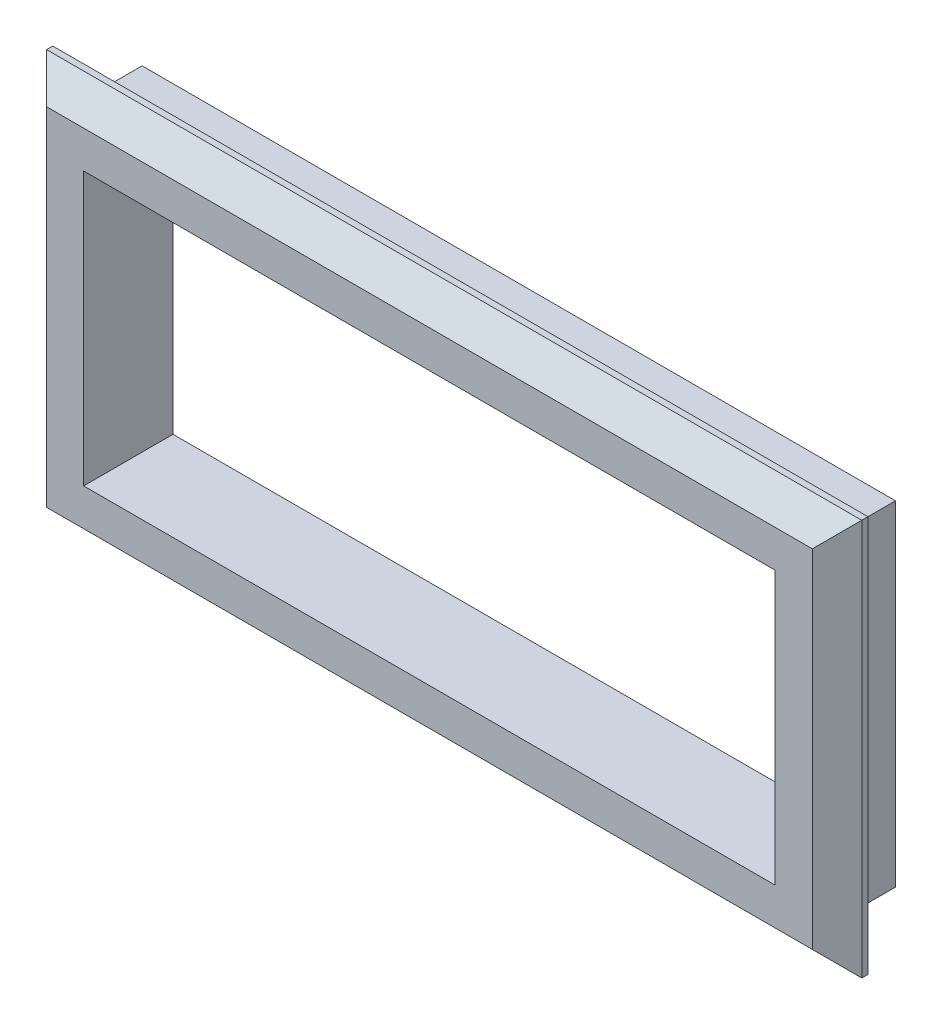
ISO-10303-21;
HEADER;
FILE_DESCRIPTION(('STEP AP214'),'2;1');
FILE_NAME('part.step','',(''),(''),'','','');
FILE_SCHEMA(('AUTOMOTIVE_DESIGN { 1 0 10303 214 1 1 1 1 }'));
ENDSEC;
DATA;
#1=APPLICATION_CONTEXT('core data for automotive mechanical design processes');
#2=APPLICATION_PROTOCOL_DEFINITION('international standard','automotive_design',2000,#1);
#3=PRODUCT_CONTEXT('',#1,'mechanical');
#4=PRODUCT('Part','Part','',(#3));
#5=PRODUCT_RELATED_PRODUCT_CATEGORY('part','',(#4));
#6=PRODUCT_DEFINITION_FORMATION('','',#4);
#7=PRODUCT_DEFINITION_CONTEXT('part definition',#1,'design');
#8=PRODUCT_DEFINITION('design','',#6,#7);
#9=PRODUCT_DEFINITION_SHAPE('','',#8);
#10=(LENGTH_UNIT() NAMED_UNIT(*) SI_UNIT(.MILLI.,.METRE.));
#11=(NAMED_UNIT(*) PLANE_ANGLE_UNIT() SI_UNIT($,.RADIAN.));
#12=(NAMED_UNIT(*) SI_UNIT($,.STERADIAN.) SOLID_ANGLE_UNIT());
#13=UNCERTAINTY_MEASURE_WITH_UNIT(LENGTH_MEASURE(1.E-05),#10,'distance_accuracy_value','');
#14=(GEOMETRIC_REPRESENTATION_CONTEXT(3) GLOBAL_UNCERTAINTY_ASSIGNED_CONTEXT((#13)) GLOBAL_UNIT_ASSIGNED_CONTEXT((#10,
#11,#12)) REPRESENTATION_CONTEXT('',''));
#15=CARTESIAN_POINT('',(0.,0.,0.));
#16=DIRECTION('',(0.,0.,1.));
#17=DIRECTION('',(1.,0.,0.));
#18=AXIS2_PLACEMENT_3D('',#15,#16,#17);
#19=CARTESIAN_POINT('',(0.,0.,0.));
#20=DIRECTION('',(0.,0.,-1.));
#21=DIRECTION('',(-1.,0.,0.));
#22=AXIS2_PLACEMENT_3D('',#19,#20,#21);
#23=PLANE('',#22);
#24=DIRECTION('',(0.,-1.,0.));
#25=VECTOR('',#24,1.);
#26=CARTESIAN_POINT('',(-3.175,-3.175,0.));
#27=LINE('',#26,#25);
#28=CARTESIAN_POINT('',(-3.175,31.175,0.));
#29=VERTEX_POINT('',#28);
#30=CARTESIAN_POINT('',(-3.175,-3.175,0.));
#31=VERTEX_POINT('',#30);
#32=EDGE_CURVE('E152',#29,#31,#27,.T.);
#33=ORIENTED_EDGE('',*,*,#32,.F.);
#34=DIRECTION('',(-1.,0.,0.));
#35=VECTOR('',#34,1.);
#36=CARTESIAN_POINT('',(-3.175,31.175,0.));
#37=LINE('',#36,#35);
#38=CARTESIAN_POINT('',(74.175,31.175,0.));
#39=VERTEX_POINT('',#38);
#40=EDGE_CURVE('E211',#39,#29,#37,.T.);
#41=ORIENTED_EDGE('',*,*,#40,.F.);
#42=DIRECTION('',(0.,1.,0.));
#43=VECTOR('',#42,1.);
#44=CARTESIAN_POINT('',(74.175,-3.175,0.));
#45=LINE('',#44,#43);
#46=CARTESIAN_POINT('',(74.175,-3.175,0.));
#47=VERTEX_POINT('',#46);
#48=EDGE_CURVE('E223',#47,#39,#45,.T.);
#49=ORIENTED_EDGE('',*,*,#48,.F.);
#50=DIRECTION('',(1.,0.,0.));
#51=VECTOR('',#50,1.);
#52=CARTESIAN_POINT('',(-3.175,-3.175,0.));
#53=LINE('',#52,#51);
#54=EDGE_CURVE('E224',#31,#47,#53,.T.);
#55=ORIENTED_EDGE('',*,*,#54,.F.);
#56=EDGE_LOOP('',(#33,#41,#49,#55));
#57=FACE_BOUND('',#56,.T.);
#58=DIRECTION('',(-1.,0.,0.));
#59=VECTOR('',#58,1.);
#60=CARTESIAN_POINT('',(0.,28.,0.));
#61=LINE('',#60,#59);
#62=CARTESIAN_POINT('',(71.,28.,0.));
#63=VERTEX_POINT('',#62);
#64=CARTESIAN_POINT('',(0.,28.,0.));
#65=VERTEX_POINT('',#64);
#66=EDGE_CURVE('E199',#63,#65,#61,.T.);
#67=ORIENTED_EDGE('',*,*,#66,.T.);
#68=DIRECTION('',(0.,-1.,0.));
#69=VECTOR('',#68,1.);
#70=CARTESIAN_POINT('',(0.,0.,0.));
#71=LINE('',#70,#69);
#72=CARTESIAN_POINT('',(0.,0.,0.));
#73=VERTEX_POINT('',#72);
#74=EDGE_CURVE('E193',#65,#73,#71,.T.);
#75=ORIENTED_EDGE('',*,*,#74,.T.);
#76=DIRECTION('',(1.,0.,0.));
#77=VECTOR('',#76,1.);
#78=CARTESIAN_POINT('',(0.,0.,0.));
#79=LINE('',#78,#77);
#80=CARTESIAN_POINT('',(71.,0.,0.));
#81=VERTEX_POINT('',#80);
#82=EDGE_CURVE('E151',#73,#81,#79,.T.);
#83=ORIENTED_EDGE('',*,*,#82,.T.);
#84=DIRECTION('',(0.,1.,0.));
#85=VECTOR('',#84,1.);
#86=CARTESIAN_POINT('',(71.,0.,0.));
#87=LINE('',#86,#85);
#88=EDGE_CURVE('E197',#81,#63,#87,.T.);
#89=ORIENTED_EDGE('',*,*,#88,.T.);
#90=EDGE_LOOP('',(#67,#75,#83,#89));
#91=FACE_BOUND('',#90,.T.);
#92=ADVANCED_FACE('F41',(#57,#91),#23,.T.);
#93=CARTESIAN_POINT('',(-3.175,-3.175,6.));
#94=DIRECTION('',(1.,0.,0.));
#95=DIRECTION('',(0.,0.,-1.));
#96=AXIS2_PLACEMENT_3D('',#93,#94,#95);
#97=PLANE('',#96);
#98=ORIENTED_EDGE('',*,*,#32,.T.);
#99=DIRECTION('',(0.,0.,-1.));
#100=VECTOR('',#99,1.);
#101=CARTESIAN_POINT('',(-3.175,-3.175,6.));
#102=LINE('',#101,#100);
#103=CARTESIAN_POINT('',(-3.175,-3.175,6.));
#104=VERTEX_POINT('',#103);
#105=EDGE_CURVE('E237',#104,#31,#102,.T.);
#106=ORIENTED_EDGE('',*,*,#105,.F.);
#107=DIRECTION('',(0.,-1.,0.));
#108=VECTOR('',#107,1.);
#109=CARTESIAN_POINT('',(-3.175,-3.175,6.));
#110=LINE('',#109,#108);
#111=CARTESIAN_POINT('',(-3.175,31.175,6.));
#112=VERTEX_POINT('',#111);
#113=EDGE_CURVE('E210',#112,#104,#110,.T.);
#114=ORIENTED_EDGE('',*,*,#113,.F.);
#115=DIRECTION('',(0.,0.,-1.));
#116=VECTOR('',#115,1.);
#117=CARTESIAN_POINT('',(-3.175,31.175,6.));
#118=LINE('',#117,#116);
#119=EDGE_CURVE('E219',#112,#29,#118,.T.);
#120=ORIENTED_EDGE('',*,*,#119,.T.);
#121=EDGE_LOOP('',(#98,#106,#114,#120));
#122=FACE_BOUND('',#121,.T.);
#123=ADVANCED_FACE('F300',(#122),#97,.F.);
#124=CARTESIAN_POINT('',(-3.175,-3.175,6.));
#125=DIRECTION('',(0.,1.,0.));
#126=DIRECTION('',(0.,0.,1.));
#127=AXIS2_PLACEMENT_3D('',#124,#125,#126);
#128=PLANE('',#127);
#129=ORIENTED_EDGE('',*,*,#54,.T.);
#130=DIRECTION('',(0.,0.,-1.));
#131=VECTOR('',#130,1.);
#132=CARTESIAN_POINT('',(74.175,-3.175,6.));
#133=LINE('',#132,#131);
#134=CARTESIAN_POINT('',(74.175,-3.175,6.));
#135=VERTEX_POINT('',#134);
#136=EDGE_CURVE('E235',#135,#47,#133,.T.);
#137=ORIENTED_EDGE('',*,*,#136,.F.);
#138=DIRECTION('',(1.,0.,0.));
#139=VECTOR('',#138,1.);
#140=CARTESIAN_POINT('',(-3.175,-3.175,6.));
#141=LINE('',#140,#139);
#142=EDGE_CURVE('E209',#104,#135,#141,.T.);
#143=ORIENTED_EDGE('',*,*,#142,.F.);
#144=ORIENTED_EDGE('',*,*,#105,.T.);
#145=EDGE_LOOP('',(#129,#137,#143,#144));
#146=FACE_BOUND('',#145,.T.);
#147=ADVANCED_FACE('F303',(#146),#128,.F.);
#148=CARTESIAN_POINT('',(74.175,-3.175,6.));
#149=DIRECTION('',(-1.,0.,0.));
#150=DIRECTION('',(0.,0.,1.));
#151=AXIS2_PLACEMENT_3D('',#148,#149,#150);
#152=PLANE('',#151);
#153=ORIENTED_EDGE('',*,*,#48,.T.);
#154=DIRECTION('',(0.,0.,-1.));
#155=VECTOR('',#154,1.);
#156=CARTESIAN_POINT('',(74.175,31.175,6.));
#157=LINE('',#156,#155);
#158=CARTESIAN_POINT('',(74.175,31.175,6.));
#159=VERTEX_POINT('',#158);
#160=EDGE_CURVE('E227',#159,#39,#157,.T.);
#161=ORIENTED_EDGE('',*,*,#160,.F.);
#162=DIRECTION('',(0.,1.,0.));
#163=VECTOR('',#162,1.);
#164=CARTESIAN_POINT('',(74.175,-3.175,6.));
#165=LINE('',#164,#163);
#166=EDGE_CURVE('E212',#135,#159,#165,.T.);
#167=ORIENTED_EDGE('',*,*,#166,.F.);
#168=ORIENTED_EDGE('',*,*,#136,.T.);
#169=EDGE_LOOP('',(#153,#161,#167,#168));
#170=FACE_BOUND('',#169,.T.);
#171=ADVANCED_FACE('F312',(#170),#152,.F.);
#172=CARTESIAN_POINT('',(-3.175,31.175,6.));
#173=DIRECTION('',(0.,-1.,0.));
#174=DIRECTION('',(0.,0.,-1.));
#175=AXIS2_PLACEMENT_3D('',#172,#173,#174);
#176=PLANE('',#175);
#177=ORIENTED_EDGE('',*,*,#40,.T.);
#178=ORIENTED_EDGE('',*,*,#119,.F.);
#179=DIRECTION('',(-1.,0.,0.));
#180=VECTOR('',#179,1.);
#181=CARTESIAN_POINT('',(-3.175,31.175,6.));
#182=LINE('',#181,#180);
#183=EDGE_CURVE('E220',#159,#112,#182,.T.);
#184=ORIENTED_EDGE('',*,*,#183,.F.);
#185=ORIENTED_EDGE('',*,*,#160,.T.);
#186=EDGE_LOOP('',(#177,#178,#184,#185));
#187=FACE_BOUND('',#186,.T.);
#188=ADVANCED_FACE('F315',(#187),#176,.F.);
#189=CARTESIAN_POINT('',(0.,0.,6.));
#190=DIRECTION('',(1.,0.,0.));
#191=DIRECTION('',(0.,0.,-1.));
#192=AXIS2_PLACEMENT_3D('',#189,#190,#191);
#193=PLANE('',#192);
#194=ORIENTED_EDGE('',*,*,#74,.F.);
#195=DIRECTION('',(0.,0.,-1.));
#196=VECTOR('',#195,1.);
#197=CARTESIAN_POINT('',(0.,28.,6.));
#198=LINE('',#197,#196);
#199=CARTESIAN_POINT('',(0.,28.,9.175));
#200=VERTEX_POINT('',#199);
#201=EDGE_CURVE('E161',#200,#65,#198,.T.);
#202=ORIENTED_EDGE('',*,*,#201,.F.);
#203=DIRECTION('',(0.,-1.,0.));
#204=VECTOR('',#203,1.);
#205=CARTESIAN_POINT('',(0.,28.,9.175));
#206=LINE('',#205,#204);
#207=CARTESIAN_POINT('',(0.,0.,9.175));
#208=VERTEX_POINT('',#207);
#209=EDGE_CURVE('E158',#200,#208,#206,.T.);
#210=ORIENTED_EDGE('',*,*,#209,.T.);
#211=DIRECTION('',(0.,0.,-1.));
#212=VECTOR('',#211,1.);
#213=CARTESIAN_POINT('',(0.,0.,6.));
#214=LINE('',#213,#212);
#215=EDGE_CURVE('E145',#208,#73,#214,.T.);
#216=ORIENTED_EDGE('',*,*,#215,.T.);
#217=EDGE_LOOP('',(#194,#202,#210,#216));
#218=FACE_BOUND('',#217,.T.);
#219=ADVANCED_FACE('F157',(#218),#193,.T.);
#220=CARTESIAN_POINT('',(0.,0.,6.));
#221=DIRECTION('',(0.,1.,0.));
#222=DIRECTION('',(0.,0.,1.));
#223=AXIS2_PLACEMENT_3D('',#220,#221,#222);
#224=PLANE('',#223);
#225=ORIENTED_EDGE('',*,*,#82,.F.);
#226=ORIENTED_EDGE('',*,*,#215,.F.);
#227=DIRECTION('',(1.,0.,0.));
#228=VECTOR('',#227,1.);
#229=CARTESIAN_POINT('',(0.,0.,9.175));
#230=LINE('',#229,#228);
#231=CARTESIAN_POINT('',(71.,0.,9.175));
#232=VERTEX_POINT('',#231);
#233=EDGE_CURVE('E146',#208,#232,#230,.T.);
#234=ORIENTED_EDGE('',*,*,#233,.T.);
#235=DIRECTION('',(0.,0.,-1.));
#236=VECTOR('',#235,1.);
#237=CARTESIAN_POINT('',(71.,0.,6.));
#238=LINE('',#237,#236);
#239=EDGE_CURVE('E154',#232,#81,#238,.T.);
#240=ORIENTED_EDGE('',*,*,#239,.T.);
#241=EDGE_LOOP('',(#225,#226,#234,#240));
#242=FACE_BOUND('',#241,.T.);
#243=ADVANCED_FACE('F148',(#242),#224,.T.);
#244=CARTESIAN_POINT('',(71.,0.,6.));
#245=DIRECTION('',(-1.,0.,0.));
#246=DIRECTION('',(0.,0.,1.));
#247=AXIS2_PLACEMENT_3D('',#244,#245,#246);
#248=PLANE('',#247);
#249=ORIENTED_EDGE('',*,*,#88,.F.);
#250=ORIENTED_EDGE('',*,*,#239,.F.);
#251=DIRECTION('',(0.,1.,0.));
#252=VECTOR('',#251,1.);
#253=CARTESIAN_POINT('',(71.,28.,9.175));
#254=LINE('',#253,#252);
#255=CARTESIAN_POINT('',(71.,28.,9.175));
#256=VERTEX_POINT('',#255);
#257=EDGE_CURVE('E169',#232,#256,#254,.T.);
#258=ORIENTED_EDGE('',*,*,#257,.T.);
#259=DIRECTION('',(0.,0.,-1.));
#260=VECTOR('',#259,1.);
#261=CARTESIAN_POINT('',(71.,28.,6.));
#262=LINE('',#261,#260);
#263=EDGE_CURVE('E204',#256,#63,#262,.T.);
#264=ORIENTED_EDGE('',*,*,#263,.T.);
#265=EDGE_LOOP('',(#249,#250,#258,#264));
#266=FACE_BOUND('',#265,.T.);
#267=ADVANCED_FACE('F351',(#266),#248,.T.);
#268=CARTESIAN_POINT('',(0.,28.,6.));
#269=DIRECTION('',(0.,-1.,0.));
#270=DIRECTION('',(0.,0.,-1.));
#271=AXIS2_PLACEMENT_3D('',#268,#269,#270);
#272=PLANE('',#271);
#273=ORIENTED_EDGE('',*,*,#66,.F.);
#274=ORIENTED_EDGE('',*,*,#263,.F.);
#275=DIRECTION('',(-1.,0.,0.));
#276=VECTOR('',#275,1.);
#277=CARTESIAN_POINT('',(0.,28.,9.175));
#278=LINE('',#277,#276);
#279=EDGE_CURVE('E168',#256,#200,#278,.T.);
#280=ORIENTED_EDGE('',*,*,#279,.T.);
#281=ORIENTED_EDGE('',*,*,#201,.T.);
#282=EDGE_LOOP('',(#273,#274,#280,#281));
#283=FACE_BOUND('',#282,.T.);
#284=ADVANCED_FACE('F294',(#283),#272,.T.);
#285=CARTESIAN_POINT('',(0.,0.,6.));
#286=DIRECTION('',(0.,0.,1.));
#287=DIRECTION('',(1.,0.,0.));
#288=AXIS2_PLACEMENT_3D('',#285,#286,#287);
#289=PLANE('',#288);
#290=DIRECTION('',(0.,-1.,0.));
#291=VECTOR('',#290,1.);
#292=CARTESIAN_POINT('',(-6.35,34.35,6.));
#293=LINE('',#292,#291);
#294=CARTESIAN_POINT('',(-6.35,34.35,6.));
#295=VERTEX_POINT('',#294);
#296=CARTESIAN_POINT('',(-6.35,-6.35,6.));
#297=VERTEX_POINT('',#296);
#298=EDGE_CURVE('E173',#295,#297,#293,.T.);
#299=ORIENTED_EDGE('',*,*,#298,.F.);
#300=DIRECTION('',(-1.,0.,0.));
#301=VECTOR('',#300,1.);
#302=CARTESIAN_POINT('',(-6.35,34.35,6.));
#303=LINE('',#302,#301);
#304=CARTESIAN_POINT('',(77.35,34.35,6.));
#305=VERTEX_POINT('',#304);
#306=EDGE_CURVE('E181',#305,#295,#303,.T.);
#307=ORIENTED_EDGE('',*,*,#306,.F.);
#308=DIRECTION('',(0.,1.,0.));
#309=VECTOR('',#308,1.);
#310=CARTESIAN_POINT('',(77.35,34.35,6.));
#311=LINE('',#310,#309);
#312=CARTESIAN_POINT('',(77.35,-6.35,6.));
#313=VERTEX_POINT('',#312);
#314=EDGE_CURVE('E177',#313,#305,#311,.T.);
#315=ORIENTED_EDGE('',*,*,#314,.F.);
#316=DIRECTION('',(1.,0.,0.));
#317=VECTOR('',#316,1.);
#318=CARTESIAN_POINT('',(-6.35,-6.35,6.));
#319=LINE('',#318,#317);
#320=EDGE_CURVE('E176',#297,#313,#319,.T.);
#321=ORIENTED_EDGE('',*,*,#320,.F.);
#322=EDGE_LOOP('',(#299,#307,#315,#321));
#323=FACE_BOUND('',#322,.T.);
#324=ORIENTED_EDGE('',*,*,#183,.T.);
#325=ORIENTED_EDGE('',*,*,#113,.T.);
#326=ORIENTED_EDGE('',*,*,#142,.T.);
#327=ORIENTED_EDGE('',*,*,#166,.T.);
#328=EDGE_LOOP('',(#324,#325,#326,#327));
#329=FACE_BOUND('',#328,.T.);
#330=ADVANCED_FACE('F289',(#323,#329),#289,.F.);
#331=CARTESIAN_POINT('',(0.,0.,9.175));
#332=DIRECTION('',(0.,0.,1.));
#333=DIRECTION('',(1.,0.,0.));
#334=AXIS2_PLACEMENT_3D('',#331,#332,#333);
#335=PLANE('',#334);
#336=DIRECTION('',(1.,0.,0.));
#337=VECTOR('',#336,1.);
#338=CARTESIAN_POINT('',(77.35,-3.81000000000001,9.175));
#339=LINE('',#338,#337);
#340=CARTESIAN_POINT('',(-3.81000000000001,-3.81000000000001,9.175));
#341=VERTEX_POINT('',#340);
#342=CARTESIAN_POINT('',(74.81,-3.81000000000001,9.175));
#343=VERTEX_POINT('',#342);
#344=EDGE_CURVE('E245',#341,#343,#339,.T.);
#345=ORIENTED_EDGE('',*,*,#344,.T.);
#346=DIRECTION('',(0.,1.,0.));
#347=VECTOR('',#346,1.);
#348=CARTESIAN_POINT('',(74.81,34.35,9.175));
#349=LINE('',#348,#347);
#350=CARTESIAN_POINT('',(74.81,31.81,9.175));
#351=VERTEX_POINT('',#350);
#352=EDGE_CURVE('E242',#343,#351,#349,.T.);
#353=ORIENTED_EDGE('',*,*,#352,.T.);
#354=DIRECTION('',(-1.,0.,0.));
#355=VECTOR('',#354,1.);
#356=CARTESIAN_POINT('',(-6.35,31.81,9.175));
#357=LINE('',#356,#355);
#358=CARTESIAN_POINT('',(-3.81000000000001,31.81,9.175));
#359=VERTEX_POINT('',#358);
#360=EDGE_CURVE('E239',#351,#359,#357,.T.);
#361=ORIENTED_EDGE('',*,*,#360,.T.);
#362=DIRECTION('',(0.,-1.,0.));
#363=VECTOR('',#362,1.);
#364=CARTESIAN_POINT('',(-3.81000000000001,-6.35,9.175));
#365=LINE('',#364,#363);
#366=EDGE_CURVE('E244',#359,#341,#365,.T.);
#367=ORIENTED_EDGE('',*,*,#366,.T.);
#368=EDGE_LOOP('',(#345,#353,#361,#367));
#369=FACE_BOUND('',#368,.T.);
#370=ORIENTED_EDGE('',*,*,#233,.F.);
#371=ORIENTED_EDGE('',*,*,#209,.F.);
#372=ORIENTED_EDGE('',*,*,#279,.F.);
#373=ORIENTED_EDGE('',*,*,#257,.F.);
#374=EDGE_LOOP('',(#370,#371,#372,#373));
#375=FACE_BOUND('',#374,.T.);
#376=ADVANCED_FACE('F167',(#369,#375),#335,.T.);
#377=CARTESIAN_POINT('',(-6.35,34.35,9.175));
#378=DIRECTION('',(1.,0.,0.));
#379=DIRECTION('',(0.,1.,0.));
#380=AXIS2_PLACEMENT_3D('',#377,#378,#379);
#381=PLANE('',#380);
#382=DIRECTION('',(0.,0.,-1.));
#383=VECTOR('',#382,1.);
#384=CARTESIAN_POINT('',(-6.35,-6.35,9.175));
#385=LINE('',#384,#383);
#386=CARTESIAN_POINT('',(-6.35,-6.35,6.63500000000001));
#387=VERTEX_POINT('',#386);
#388=EDGE_CURVE('E191',#387,#297,#385,.T.);
#389=ORIENTED_EDGE('',*,*,#388,.F.);
#390=DIRECTION('',(0.,1.,0.));
#391=VECTOR('',#390,1.);
#392=CARTESIAN_POINT('',(-6.35,34.35,6.63500000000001));
#393=LINE('',#392,#391);
#394=CARTESIAN_POINT('',(-6.35,34.35,6.63500000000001));
#395=VERTEX_POINT('',#394);
#396=EDGE_CURVE('E51',#387,#395,#393,.T.);
#397=ORIENTED_EDGE('',*,*,#396,.T.);
#398=DIRECTION('',(0.,0.,-1.));
#399=VECTOR('',#398,1.);
#400=CARTESIAN_POINT('',(-6.35,34.35,9.175));
#401=LINE('',#400,#399);
#402=EDGE_CURVE('E189',#395,#295,#401,.T.);
#403=ORIENTED_EDGE('',*,*,#402,.T.);
#404=ORIENTED_EDGE('',*,*,#298,.T.);
#405=EDGE_LOOP('',(#389,#397,#403,#404));
#406=FACE_BOUND('',#405,.T.);
#407=ADVANCED_FACE('F282',(#406),#381,.F.);
#408=CARTESIAN_POINT('',(-6.35,-6.35,9.175));
#409=DIRECTION('',(0.,1.,0.));
#410=DIRECTION('',(0.,0.,1.));
#411=AXIS2_PLACEMENT_3D('',#408,#409,#410);
#412=PLANE('',#411);
#413=DIRECTION('',(0.,0.,-1.));
#414=VECTOR('',#413,1.);
#415=CARTESIAN_POINT('',(77.35,-6.35,9.175));
#416=LINE('',#415,#414);
#417=CARTESIAN_POINT('',(77.35,-6.35,6.63500000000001));
#418=VERTEX_POINT('',#417);
#419=EDGE_CURVE('E187',#418,#313,#416,.T.);
#420=ORIENTED_EDGE('',*,*,#419,.F.);
#421=DIRECTION('',(-1.,0.,0.));
#422=VECTOR('',#421,1.);
#423=CARTESIAN_POINT('',(-6.35,-6.35,6.63500000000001));
#424=LINE('',#423,#422);
#425=EDGE_CURVE('E69',#418,#387,#424,.T.);
#426=ORIENTED_EDGE('',*,*,#425,.T.);
#427=ORIENTED_EDGE('',*,*,#388,.T.);
#428=ORIENTED_EDGE('',*,*,#320,.T.);
#429=EDGE_LOOP('',(#420,#426,#427,#428));
#430=FACE_BOUND('',#429,.T.);
#431=ADVANCED_FACE('F295',(#430),#412,.F.);
#432=CARTESIAN_POINT('',(77.35,34.35,9.175));
#433=DIRECTION('',(-1.,0.,0.));
#434=DIRECTION('',(0.,0.,1.));
#435=AXIS2_PLACEMENT_3D('',#432,#433,#434);
#436=PLANE('',#435);
#437=DIRECTION('',(0.,0.,-1.));
#438=VECTOR('',#437,1.);
#439=CARTESIAN_POINT('',(77.35,34.35,9.175));
#440=LINE('',#439,#438);
#441=CARTESIAN_POINT('',(77.35,34.35,6.63500000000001));
#442=VERTEX_POINT('',#441);
#443=EDGE_CURVE('E190',#442,#305,#440,.T.);
#444=ORIENTED_EDGE('',*,*,#443,.F.);
#445=DIRECTION('',(0.,-1.,0.));
#446=VECTOR('',#445,1.);
#447=CARTESIAN_POINT('',(77.35,-6.35,6.63500000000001));
#448=LINE('',#447,#446);
#449=EDGE_CURVE('E250',#442,#418,#448,.T.);
#450=ORIENTED_EDGE('',*,*,#449,.T.);
#451=ORIENTED_EDGE('',*,*,#419,.T.);
#452=ORIENTED_EDGE('',*,*,#314,.T.);
#453=EDGE_LOOP('',(#444,#450,#451,#452));
#454=FACE_BOUND('',#453,.T.);
#455=ADVANCED_FACE('F280',(#454),#436,.F.);
#456=CARTESIAN_POINT('',(-6.35,34.35,9.175));
#457=DIRECTION('',(0.,-1.,0.));
#458=DIRECTION('',(0.,0.,-1.));
#459=AXIS2_PLACEMENT_3D('',#456,#457,#458);
#460=PLANE('',#459);
#461=ORIENTED_EDGE('',*,*,#402,.F.);
#462=DIRECTION('',(1.,0.,0.));
#463=VECTOR('',#462,1.);
#464=CARTESIAN_POINT('',(77.35,34.35,6.63500000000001));
#465=LINE('',#464,#463);
#466=EDGE_CURVE('E11',#395,#442,#465,.T.);
#467=ORIENTED_EDGE('',*,*,#466,.T.);
#468=ORIENTED_EDGE('',*,*,#443,.T.);
#469=ORIENTED_EDGE('',*,*,#306,.T.);
#470=EDGE_LOOP('',(#461,#467,#468,#469));
#471=FACE_BOUND('',#470,.T.);
#472=ADVANCED_FACE('F273',(#471),#460,.F.);
#473=CARTESIAN_POINT('',(-3.81000000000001,0.,9.175));
#474=DIRECTION('',(-0.707106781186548,0.,0.707106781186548));
#475=DIRECTION('',(0.,1.,0.));
#476=AXIS2_PLACEMENT_3D('',#473,#474,#475);
#477=PLANE('',#476);
#478=DIRECTION('',(0.577350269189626,-0.577350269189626,0.577350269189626));
#479=VECTOR('',#478,1.);
#480=CARTESIAN_POINT('',(-2.54000000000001,30.54,10.445));
#481=LINE('',#480,#479);
#482=EDGE_CURVE('E258',#395,#359,#481,.T.);
#483=ORIENTED_EDGE('',*,*,#482,.F.);
#484=ORIENTED_EDGE('',*,*,#396,.F.);
#485=DIRECTION('',(0.577350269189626,0.577350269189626,0.577350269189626));
#486=VECTOR('',#485,1.);
#487=CARTESIAN_POINT('',(-2.54,-2.54000000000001,10.445));
#488=LINE('',#487,#486);
#489=EDGE_CURVE('E46',#341,#387,#488,.F.);
#490=ORIENTED_EDGE('',*,*,#489,.F.);
#491=ORIENTED_EDGE('',*,*,#366,.F.);
#492=EDGE_LOOP('',(#483,#484,#490,#491));
#493=FACE_BOUND('',#492,.T.);
#494=ADVANCED_FACE('F42',(#493),#477,.T.);
#495=CARTESIAN_POINT('',(0.,-3.81000000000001,9.175));
#496=DIRECTION('',(0.,-0.707106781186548,0.707106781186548));
#497=DIRECTION('',(-1.,0.,0.));
#498=AXIS2_PLACEMENT_3D('',#495,#496,#497);
#499=PLANE('',#498);
#500=ORIENTED_EDGE('',*,*,#489,.T.);
#501=ORIENTED_EDGE('',*,*,#425,.F.);
#502=DIRECTION('',(-0.577350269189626,0.577350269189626,0.577350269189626));
#503=VECTOR('',#502,1.);
#504=CARTESIAN_POINT('',(49.8733333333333,21.1266666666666,34.1116666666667));
#505=LINE('',#504,#503);
#506=EDGE_CURVE('E254',#343,#418,#505,.F.);
#507=ORIENTED_EDGE('',*,*,#506,.F.);
#508=ORIENTED_EDGE('',*,*,#344,.F.);
#509=EDGE_LOOP('',(#500,#501,#507,#508));
#510=FACE_BOUND('',#509,.T.);
#511=ADVANCED_FACE('F266',(#510),#499,.T.);
#512=CARTESIAN_POINT('',(0.,31.81,9.175));
#513=DIRECTION('',(0.,0.707106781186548,0.707106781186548));
#514=DIRECTION('',(1.,0.,0.));
#515=AXIS2_PLACEMENT_3D('',#512,#513,#514);
#516=PLANE('',#515);
#517=ORIENTED_EDGE('',*,*,#482,.T.);
#518=ORIENTED_EDGE('',*,*,#360,.F.);
#519=DIRECTION('',(0.577350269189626,0.577350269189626,-0.577350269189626));
#520=VECTOR('',#519,1.);
#521=CARTESIAN_POINT('',(49.8733333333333,6.87333333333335,34.1116666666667));
#522=LINE('',#521,#520);
#523=EDGE_CURVE('E251',#442,#351,#522,.F.);
#524=ORIENTED_EDGE('',*,*,#523,.F.);
#525=ORIENTED_EDGE('',*,*,#466,.F.);
#526=EDGE_LOOP('',(#517,#518,#524,#525));
#527=FACE_BOUND('',#526,.T.);
#528=ADVANCED_FACE('F271',(#527),#516,.T.);
#529=CARTESIAN_POINT('',(74.81,0.,9.175));
#530=DIRECTION('',(0.707106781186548,0.,0.707106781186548));
#531=DIRECTION('',(0.,-1.,0.));
#532=AXIS2_PLACEMENT_3D('',#529,#530,#531);
#533=PLANE('',#532);
#534=ORIENTED_EDGE('',*,*,#506,.T.);
#535=ORIENTED_EDGE('',*,*,#449,.F.);
#536=ORIENTED_EDGE('',*,*,#523,.T.);
#537=ORIENTED_EDGE('',*,*,#352,.F.);
#538=EDGE_LOOP('',(#534,#535,#536,#537));
#539=FACE_BOUND('',#538,.T.);
#540=ADVANCED_FACE('F284',(#539),#533,.T.);
#541=CLOSED_SHELL('',(#92,#123,#147,#171,#188,#219,#243,#267,#284,#330,#376,#407,#431,#455,#472,
#494,#511,#528,#540));
#542=MANIFOLD_SOLID_BREP('B2',#541);
#543=ADVANCED_BREP_SHAPE_REPRESENTATION('',(#18,#542),#14);
#544=SHAPE_DEFINITION_REPRESENTATION(#9,#543);
ENDSEC;
END-ISO-10303-21;
